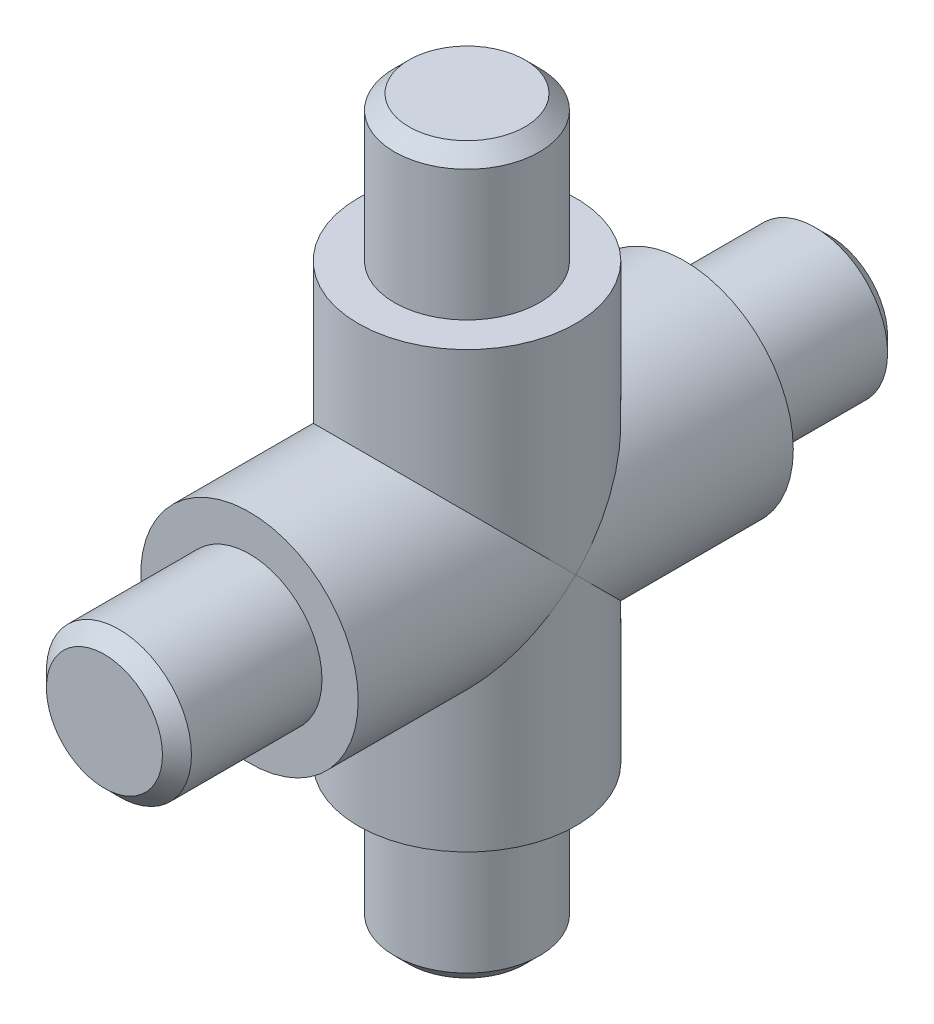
from build123d import *

# Parameters (mm, degrees)
ESQUISSE1_R             = 5
BASE_EXTRUSION_DEPTH    = 50
BOSS_EXTRU_1_DEPTH      = 25
BOSS_EXTRU_1_DEPTH_BACK = 25
ESQUISSE2_R             = 5
BOSS_EXTRU_2_DEPTH      = 15
BOSS_EXTRU_2_DEPTH_BACK = 15
ESQUISSE4_R             = 7.5
BOSS_EXTRU_3_DEPTH      = 15
BOSS_EXTRU_3_DEPTH_BACK = 15
ESQUISSE6_R             = 7.5
CHANFREIN1_SIZE         = 1


with BuildPart() as part:
    # Esquisse1 → Base-Extrusion (new body)
    with BuildSketch(Plane.XY):
        Circle(ESQUISSE1_R)
    extrude(amount=BASE_EXTRUSION_DEPTH)

    # Esquisse2 → Boss.-Extru.1 (add, two sides: drawn at the far end of the back side and taken through both)
    with BuildSketch(Plane(origin=(0, 0, 0), x_dir=(1, 0, 0), z_dir=(0, 1, 0)).offset(-BOSS_EXTRU_1_DEPTH_BACK)):
        with Locations((0, -25)):
            Circle(ESQUISSE2_R)
    extrude(amount=BOSS_EXTRU_1_DEPTH + BOSS_EXTRU_1_DEPTH_BACK)

    # Esquisse4 → Boss.-Extru.2 (add, two sides: drawn at the far end of the back side and taken through both)
    with BuildSketch(Plane(origin=(0, 0, 0), x_dir=(1, 0, 0), z_dir=(0, 1, 0)).offset(-BOSS_EXTRU_2_DEPTH_BACK)):
        with Locations(Location((0, -25, 0), (0, 0, 270))):
            Circle(ESQUISSE4_R)
    extrude(amount=BOSS_EXTRU_2_DEPTH + BOSS_EXTRU_2_DEPTH_BACK)

    # Esquisse6 → Boss.-Extru.3 (add, two sides: drawn at the far end of the back side and taken through both)
    with BuildSketch(Plane.XY.offset(25).offset(-BOSS_EXTRU_3_DEPTH_BACK)):
        Circle(ESQUISSE6_R)
    extrude(amount=BOSS_EXTRU_3_DEPTH + BOSS_EXTRU_3_DEPTH_BACK)

    # Chanfrein1
    chanfrein1_edges = [part.edges().sort_by_distance(p)[0] for p in [
        (-5, 0, 0),
        (-5, 0, 50),
        (-5, -25, 25),
        (-5, 25, 25),
    ]]
    chamfer(chanfrein1_edges, length=CHANFREIN1_SIZE)


solid = part.part
